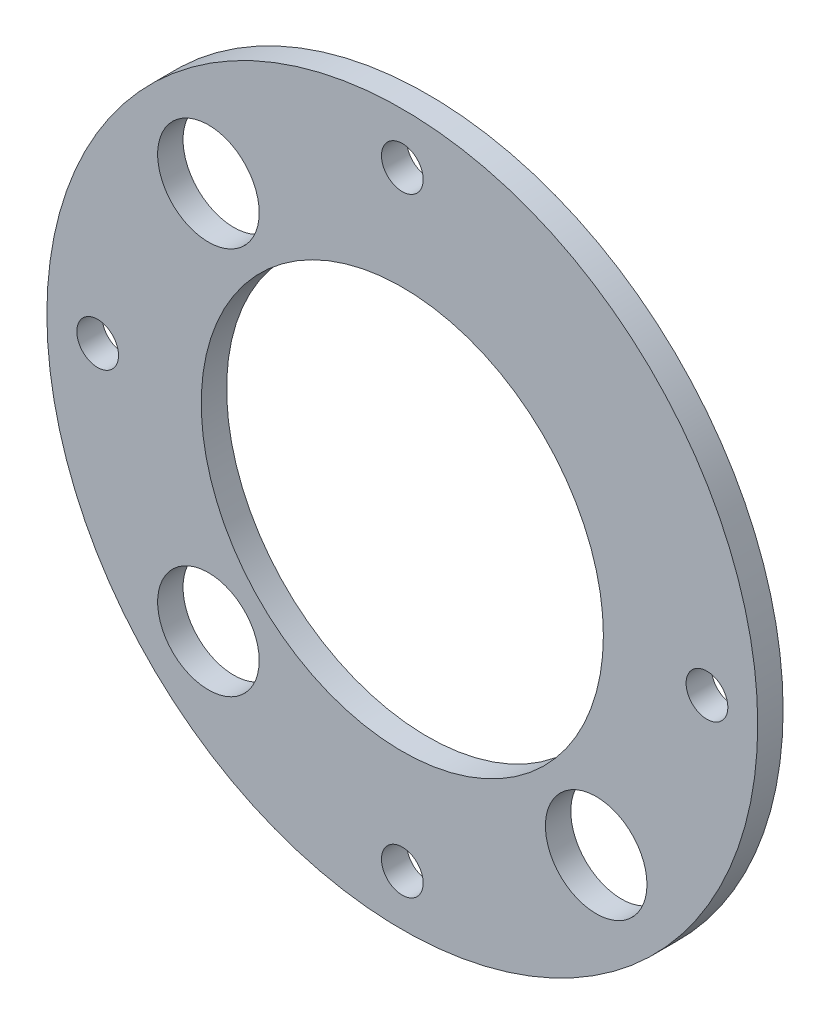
ISO-10303-21;
HEADER;
FILE_DESCRIPTION(('STEP AP214'),'2;1');
FILE_NAME('part.step','',(''),(''),'','','');
FILE_SCHEMA(('AUTOMOTIVE_DESIGN { 1 0 10303 214 1 1 1 1 }'));
ENDSEC;
DATA;
#1=APPLICATION_CONTEXT('core data for automotive mechanical design processes');
#2=APPLICATION_PROTOCOL_DEFINITION('international standard','automotive_design',2000,#1);
#3=PRODUCT_CONTEXT('',#1,'mechanical');
#4=PRODUCT('Part','Part','',(#3));
#5=PRODUCT_RELATED_PRODUCT_CATEGORY('part','',(#4));
#6=PRODUCT_DEFINITION_FORMATION('','',#4);
#7=PRODUCT_DEFINITION_CONTEXT('part definition',#1,'design');
#8=PRODUCT_DEFINITION('design','',#6,#7);
#9=PRODUCT_DEFINITION_SHAPE('','',#8);
#10=(LENGTH_UNIT() NAMED_UNIT(*) SI_UNIT(.MILLI.,.METRE.));
#11=(NAMED_UNIT(*) PLANE_ANGLE_UNIT() SI_UNIT($,.RADIAN.));
#12=(NAMED_UNIT(*) SI_UNIT($,.STERADIAN.) SOLID_ANGLE_UNIT());
#13=UNCERTAINTY_MEASURE_WITH_UNIT(LENGTH_MEASURE(1.E-05),#10,'distance_accuracy_value','');
#14=(GEOMETRIC_REPRESENTATION_CONTEXT(3) GLOBAL_UNCERTAINTY_ASSIGNED_CONTEXT((#13)) GLOBAL_UNIT_ASSIGNED_CONTEXT((#10,
#11,#12)) REPRESENTATION_CONTEXT('',''));
#15=CARTESIAN_POINT('',(0.,0.,0.));
#16=DIRECTION('',(0.,0.,1.));
#17=DIRECTION('',(1.,0.,0.));
#18=AXIS2_PLACEMENT_3D('',#15,#16,#17);
#19=CARTESIAN_POINT('',(0.,0.,3.175));
#20=DIRECTION('',(0.,0.,1.));
#21=DIRECTION('',(1.,0.,0.));
#22=AXIS2_PLACEMENT_3D('',#19,#20,#21);
#23=PLANE('',#22);
#24=CARTESIAN_POINT('',(24.2466915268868,-24.2466915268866,3.175));
#25=DIRECTION('',(0.,0.,1.));
#26=DIRECTION('',(1.,0.,0.));
#27=AXIS2_PLACEMENT_3D('',#24,#25,#26);
#28=CIRCLE('',#27,6.35);
#29=CARTESIAN_POINT('',(30.5966915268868,-24.2466915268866,3.175));
#30=VERTEX_POINT('',#29);
#31=EDGE_CURVE('E88',#30,#30,#28,.T.);
#32=ORIENTED_EDGE('',*,*,#31,.F.);
#33=EDGE_LOOP('',(#32));
#34=FACE_BOUND('',#33,.T.);
#35=CARTESIAN_POINT('',(-24.2466915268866,-24.2466915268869,3.175));
#36=DIRECTION('',(0.,0.,1.));
#37=DIRECTION('',(1.,0.,0.));
#38=AXIS2_PLACEMENT_3D('',#35,#36,#37);
#39=CIRCLE('',#38,6.35);
#40=CARTESIAN_POINT('',(-17.8966915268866,-24.2466915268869,3.175));
#41=VERTEX_POINT('',#40);
#42=EDGE_CURVE('E82',#41,#41,#39,.T.);
#43=ORIENTED_EDGE('',*,*,#42,.F.);
#44=EDGE_LOOP('',(#43));
#45=FACE_BOUND('',#44,.T.);
#46=CARTESIAN_POINT('',(-24.2466915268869,24.2466915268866,3.175));
#47=DIRECTION('',(0.,0.,1.));
#48=DIRECTION('',(1.,0.,0.));
#49=AXIS2_PLACEMENT_3D('',#46,#47,#48);
#50=CIRCLE('',#49,6.35);
#51=CARTESIAN_POINT('',(-17.8966915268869,24.2466915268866,3.175));
#52=VERTEX_POINT('',#51);
#53=EDGE_CURVE('E76',#52,#52,#50,.T.);
#54=ORIENTED_EDGE('',*,*,#53,.F.);
#55=EDGE_LOOP('',(#54));
#56=FACE_BOUND('',#55,.T.);
#57=CARTESIAN_POINT('',(0.,38.1,3.175));
#58=DIRECTION('',(0.,0.,-1.));
#59=DIRECTION('',(-1.,0.,0.));
#60=AXIS2_PLACEMENT_3D('',#57,#58,#59);
#61=CIRCLE('',#60,2.60985);
#62=CARTESIAN_POINT('',(-2.60985,38.1,3.175));
#63=VERTEX_POINT('',#62);
#64=EDGE_CURVE('E69',#63,#63,#61,.T.);
#65=ORIENTED_EDGE('',*,*,#64,.T.);
#66=EDGE_LOOP('',(#65));
#67=FACE_BOUND('',#66,.T.);
#68=CARTESIAN_POINT('',(0.,0.,3.175));
#69=DIRECTION('',(0.,0.,1.));
#70=DIRECTION('',(1.,0.,0.));
#71=AXIS2_PLACEMENT_3D('',#68,#69,#70);
#72=CIRCLE('',#71,25.146);
#73=CARTESIAN_POINT('',(25.146,0.,3.175));
#74=VERTEX_POINT('',#73);
#75=EDGE_CURVE('E44',#74,#74,#72,.T.);
#76=ORIENTED_EDGE('',*,*,#75,.F.);
#77=EDGE_LOOP('',(#76));
#78=FACE_BOUND('',#77,.T.);
#79=CARTESIAN_POINT('',(0.,0.,3.175));
#80=DIRECTION('',(0.,0.,1.));
#81=DIRECTION('',(1.,0.,0.));
#82=AXIS2_PLACEMENT_3D('',#79,#80,#81);
#83=CIRCLE('',#82,44.45);
#84=CARTESIAN_POINT('',(44.45,0.,3.175));
#85=VERTEX_POINT('',#84);
#86=EDGE_CURVE('E10',#85,#85,#83,.T.);
#87=ORIENTED_EDGE('',*,*,#86,.T.);
#88=EDGE_LOOP('',(#87));
#89=FACE_BOUND('',#88,.T.);
#90=CARTESIAN_POINT('',(38.1,0.,3.175));
#91=DIRECTION('',(0.,0.,-1.));
#92=DIRECTION('',(-1.,0.,0.));
#93=AXIS2_PLACEMENT_3D('',#90,#91,#92);
#94=CIRCLE('',#93,2.60985);
#95=CARTESIAN_POINT('',(35.49015,0.,3.175));
#96=VERTEX_POINT('',#95);
#97=EDGE_CURVE('E49',#96,#96,#94,.T.);
#98=ORIENTED_EDGE('',*,*,#97,.T.);
#99=EDGE_LOOP('',(#98));
#100=FACE_BOUND('',#99,.T.);
#101=CARTESIAN_POINT('',(0.,-38.1,3.175));
#102=DIRECTION('',(0.,0.,-1.));
#103=DIRECTION('',(-1.,0.,0.));
#104=AXIS2_PLACEMENT_3D('',#101,#102,#103);
#105=CIRCLE('',#104,2.60985);
#106=CARTESIAN_POINT('',(-2.60984999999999,-38.1,3.175));
#107=VERTEX_POINT('',#106);
#108=EDGE_CURVE('E57',#107,#107,#105,.T.);
#109=ORIENTED_EDGE('',*,*,#108,.T.);
#110=EDGE_LOOP('',(#109));
#111=FACE_BOUND('',#110,.T.);
#112=CARTESIAN_POINT('',(-38.1,0.,3.175));
#113=DIRECTION('',(0.,0.,-1.));
#114=DIRECTION('',(-1.,0.,0.));
#115=AXIS2_PLACEMENT_3D('',#112,#113,#114);
#116=CIRCLE('',#115,2.60985);
#117=CARTESIAN_POINT('',(-40.70985,0.,3.175));
#118=VERTEX_POINT('',#117);
#119=EDGE_CURVE('E63',#118,#118,#116,.T.);
#120=ORIENTED_EDGE('',*,*,#119,.T.);
#121=EDGE_LOOP('',(#120));
#122=FACE_BOUND('',#121,.T.);
#123=ADVANCED_FACE('F33',(#34,#45,#56,#67,#78,#89,#100,#111,#122),#23,.T.);
#124=CARTESIAN_POINT('',(0.,0.,0.));
#125=DIRECTION('',(0.,0.,1.));
#126=DIRECTION('',(1.,0.,0.));
#127=AXIS2_PLACEMENT_3D('',#124,#125,#126);
#128=PLANE('',#127);
#129=CARTESIAN_POINT('',(24.2466915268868,-24.2466915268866,0.));
#130=DIRECTION('',(0.,0.,1.));
#131=DIRECTION('',(1.,0.,0.));
#132=AXIS2_PLACEMENT_3D('',#129,#130,#131);
#133=CIRCLE('',#132,6.35);
#134=CARTESIAN_POINT('',(30.5966915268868,-24.2466915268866,0.));
#135=VERTEX_POINT('',#134);
#136=EDGE_CURVE('E75',#135,#135,#133,.T.);
#137=ORIENTED_EDGE('',*,*,#136,.T.);
#138=EDGE_LOOP('',(#137));
#139=FACE_BOUND('',#138,.T.);
#140=CARTESIAN_POINT('',(-24.2466915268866,-24.2466915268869,0.));
#141=DIRECTION('',(0.,0.,1.));
#142=DIRECTION('',(1.,0.,0.));
#143=AXIS2_PLACEMENT_3D('',#140,#141,#142);
#144=CIRCLE('',#143,6.35);
#145=CARTESIAN_POINT('',(-17.8966915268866,-24.2466915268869,0.));
#146=VERTEX_POINT('',#145);
#147=EDGE_CURVE('E85',#146,#146,#144,.T.);
#148=ORIENTED_EDGE('',*,*,#147,.T.);
#149=EDGE_LOOP('',(#148));
#150=FACE_BOUND('',#149,.T.);
#151=CARTESIAN_POINT('',(-24.2466915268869,24.2466915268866,0.));
#152=DIRECTION('',(0.,0.,1.));
#153=DIRECTION('',(1.,0.,0.));
#154=AXIS2_PLACEMENT_3D('',#151,#152,#153);
#155=CIRCLE('',#154,6.35);
#156=CARTESIAN_POINT('',(-17.8966915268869,24.2466915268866,0.));
#157=VERTEX_POINT('',#156);
#158=EDGE_CURVE('E79',#157,#157,#155,.T.);
#159=ORIENTED_EDGE('',*,*,#158,.T.);
#160=EDGE_LOOP('',(#159));
#161=FACE_BOUND('',#160,.T.);
#162=CARTESIAN_POINT('',(0.,38.1,0.));
#163=DIRECTION('',(0.,0.,-1.));
#164=DIRECTION('',(-1.,0.,0.));
#165=AXIS2_PLACEMENT_3D('',#162,#163,#164);
#166=CIRCLE('',#165,2.60985);
#167=CARTESIAN_POINT('',(-2.60985,38.1,0.));
#168=VERTEX_POINT('',#167);
#169=EDGE_CURVE('E72',#168,#168,#166,.T.);
#170=ORIENTED_EDGE('',*,*,#169,.F.);
#171=EDGE_LOOP('',(#170));
#172=FACE_BOUND('',#171,.T.);
#173=CARTESIAN_POINT('',(-38.1,0.,0.));
#174=DIRECTION('',(0.,0.,-1.));
#175=DIRECTION('',(-1.,0.,0.));
#176=AXIS2_PLACEMENT_3D('',#173,#174,#175);
#177=CIRCLE('',#176,2.60985);
#178=CARTESIAN_POINT('',(-40.70985,0.,0.));
#179=VERTEX_POINT('',#178);
#180=EDGE_CURVE('E66',#179,#179,#177,.T.);
#181=ORIENTED_EDGE('',*,*,#180,.F.);
#182=EDGE_LOOP('',(#181));
#183=FACE_BOUND('',#182,.T.);
#184=CARTESIAN_POINT('',(0.,-38.1,0.));
#185=DIRECTION('',(0.,0.,-1.));
#186=DIRECTION('',(-1.,0.,0.));
#187=AXIS2_PLACEMENT_3D('',#184,#185,#186);
#188=CIRCLE('',#187,2.60985);
#189=CARTESIAN_POINT('',(-2.60985,-38.1,0.));
#190=VERTEX_POINT('',#189);
#191=EDGE_CURVE('E60',#190,#190,#188,.T.);
#192=ORIENTED_EDGE('',*,*,#191,.F.);
#193=EDGE_LOOP('',(#192));
#194=FACE_BOUND('',#193,.T.);
#195=CARTESIAN_POINT('',(38.1,0.,0.));
#196=DIRECTION('',(0.,0.,-1.));
#197=DIRECTION('',(-1.,0.,0.));
#198=AXIS2_PLACEMENT_3D('',#195,#196,#197);
#199=CIRCLE('',#198,2.60985);
#200=CARTESIAN_POINT('',(35.49015,0.,0.));
#201=VERTEX_POINT('',#200);
#202=EDGE_CURVE('E54',#201,#201,#199,.T.);
#203=ORIENTED_EDGE('',*,*,#202,.F.);
#204=EDGE_LOOP('',(#203));
#205=FACE_BOUND('',#204,.T.);
#206=CARTESIAN_POINT('',(0.,0.,0.));
#207=DIRECTION('',(0.,0.,1.));
#208=DIRECTION('',(1.,0.,0.));
#209=AXIS2_PLACEMENT_3D('',#206,#207,#208);
#210=CIRCLE('',#209,44.45);
#211=CARTESIAN_POINT('',(44.45,0.,0.));
#212=VERTEX_POINT('',#211);
#213=EDGE_CURVE('E37',#212,#212,#210,.T.);
#214=ORIENTED_EDGE('',*,*,#213,.F.);
#215=EDGE_LOOP('',(#214));
#216=FACE_BOUND('',#215,.T.);
#217=CARTESIAN_POINT('',(0.,0.,0.));
#218=DIRECTION('',(0.,0.,1.));
#219=DIRECTION('',(1.,0.,0.));
#220=AXIS2_PLACEMENT_3D('',#217,#218,#219);
#221=CIRCLE('',#220,25.146);
#222=CARTESIAN_POINT('',(25.146,0.,0.));
#223=VERTEX_POINT('',#222);
#224=EDGE_CURVE('E46',#223,#223,#221,.T.);
#225=ORIENTED_EDGE('',*,*,#224,.T.);
#226=EDGE_LOOP('',(#225));
#227=FACE_BOUND('',#226,.T.);
#228=ADVANCED_FACE('F94',(#139,#150,#161,#172,#183,#194,#205,#216,#227),#128,.F.);
#229=CARTESIAN_POINT('',(0.,0.,3.175));
#230=DIRECTION('',(0.,0.,-1.));
#231=DIRECTION('',(-1.,0.,0.));
#232=AXIS2_PLACEMENT_3D('',#229,#230,#231);
#233=CYLINDRICAL_SURFACE('',#232,44.45);
#234=ORIENTED_EDGE('',*,*,#86,.F.);
#235=EDGE_LOOP('',(#234));
#236=FACE_BOUND('',#235,.T.);
#237=ORIENTED_EDGE('',*,*,#213,.T.);
#238=EDGE_LOOP('',(#237));
#239=FACE_BOUND('',#238,.T.);
#240=ADVANCED_FACE('F35',(#236,#239),#233,.T.);
#241=CARTESIAN_POINT('',(0.,0.,3.175));
#242=DIRECTION('',(0.,0.,-1.));
#243=DIRECTION('',(-1.,0.,0.));
#244=AXIS2_PLACEMENT_3D('',#241,#242,#243);
#245=CYLINDRICAL_SURFACE('',#244,25.146);
#246=ORIENTED_EDGE('',*,*,#75,.T.);
#247=EDGE_LOOP('',(#246));
#248=FACE_BOUND('',#247,.T.);
#249=ORIENTED_EDGE('',*,*,#224,.F.);
#250=EDGE_LOOP('',(#249));
#251=FACE_BOUND('',#250,.T.);
#252=ADVANCED_FACE('F139',(#248,#251),#245,.F.);
#253=CARTESIAN_POINT('',(38.1,0.,0.));
#254=DIRECTION('',(0.,0.,-1.));
#255=DIRECTION('',(-1.,0.,0.));
#256=AXIS2_PLACEMENT_3D('',#253,#254,#255);
#257=CYLINDRICAL_SURFACE('',#256,2.60985);
#258=ORIENTED_EDGE('',*,*,#97,.F.);
#259=EDGE_LOOP('',(#258));
#260=FACE_BOUND('',#259,.T.);
#261=ORIENTED_EDGE('',*,*,#202,.T.);
#262=EDGE_LOOP('',(#261));
#263=FACE_BOUND('',#262,.T.);
#264=ADVANCED_FACE('F141',(#260,#263),#257,.F.);
#265=CARTESIAN_POINT('',(0.,-38.1,0.));
#266=DIRECTION('',(0.,0.,-1.));
#267=DIRECTION('',(-1.,0.,0.));
#268=AXIS2_PLACEMENT_3D('',#265,#266,#267);
#269=CYLINDRICAL_SURFACE('',#268,2.60985);
#270=ORIENTED_EDGE('',*,*,#108,.F.);
#271=EDGE_LOOP('',(#270));
#272=FACE_BOUND('',#271,.T.);
#273=ORIENTED_EDGE('',*,*,#191,.T.);
#274=EDGE_LOOP('',(#273));
#275=FACE_BOUND('',#274,.T.);
#276=ADVANCED_FACE('F125',(#272,#275),#269,.F.);
#277=CARTESIAN_POINT('',(-38.1,0.,0.));
#278=DIRECTION('',(0.,0.,-1.));
#279=DIRECTION('',(-1.,0.,0.));
#280=AXIS2_PLACEMENT_3D('',#277,#278,#279);
#281=CYLINDRICAL_SURFACE('',#280,2.60985);
#282=ORIENTED_EDGE('',*,*,#119,.F.);
#283=EDGE_LOOP('',(#282));
#284=FACE_BOUND('',#283,.T.);
#285=ORIENTED_EDGE('',*,*,#180,.T.);
#286=EDGE_LOOP('',(#285));
#287=FACE_BOUND('',#286,.T.);
#288=ADVANCED_FACE('F121',(#284,#287),#281,.F.);
#289=CARTESIAN_POINT('',(0.,38.1,0.));
#290=DIRECTION('',(0.,0.,-1.));
#291=DIRECTION('',(-1.,0.,0.));
#292=AXIS2_PLACEMENT_3D('',#289,#290,#291);
#293=CYLINDRICAL_SURFACE('',#292,2.60985);
#294=ORIENTED_EDGE('',*,*,#64,.F.);
#295=EDGE_LOOP('',(#294));
#296=FACE_BOUND('',#295,.T.);
#297=ORIENTED_EDGE('',*,*,#169,.T.);
#298=EDGE_LOOP('',(#297));
#299=FACE_BOUND('',#298,.T.);
#300=ADVANCED_FACE('F124',(#296,#299),#293,.F.);
#301=CARTESIAN_POINT('',(-24.2466915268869,24.2466915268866,0.));
#302=DIRECTION('',(0.,0.,1.));
#303=DIRECTION('',(1.,0.,0.));
#304=AXIS2_PLACEMENT_3D('',#301,#302,#303);
#305=CYLINDRICAL_SURFACE('',#304,6.35);
#306=ORIENTED_EDGE('',*,*,#158,.F.);
#307=EDGE_LOOP('',(#306));
#308=FACE_BOUND('',#307,.T.);
#309=ORIENTED_EDGE('',*,*,#53,.T.);
#310=EDGE_LOOP('',(#309));
#311=FACE_BOUND('',#310,.T.);
#312=ADVANCED_FACE('F157',(#308,#311),#305,.F.);
#313=CARTESIAN_POINT('',(-24.2466915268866,-24.2466915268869,0.));
#314=DIRECTION('',(0.,0.,1.));
#315=DIRECTION('',(1.,0.,0.));
#316=AXIS2_PLACEMENT_3D('',#313,#314,#315);
#317=CYLINDRICAL_SURFACE('',#316,6.35);
#318=ORIENTED_EDGE('',*,*,#147,.F.);
#319=EDGE_LOOP('',(#318));
#320=FACE_BOUND('',#319,.T.);
#321=ORIENTED_EDGE('',*,*,#42,.T.);
#322=EDGE_LOOP('',(#321));
#323=FACE_BOUND('',#322,.T.);
#324=ADVANCED_FACE('F100',(#320,#323),#317,.F.);
#325=CARTESIAN_POINT('',(24.2466915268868,-24.2466915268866,0.));
#326=DIRECTION('',(0.,0.,1.));
#327=DIRECTION('',(1.,0.,0.));
#328=AXIS2_PLACEMENT_3D('',#325,#326,#327);
#329=CYLINDRICAL_SURFACE('',#328,6.35);
#330=ORIENTED_EDGE('',*,*,#136,.F.);
#331=EDGE_LOOP('',(#330));
#332=FACE_BOUND('',#331,.T.);
#333=ORIENTED_EDGE('',*,*,#31,.T.);
#334=EDGE_LOOP('',(#333));
#335=FACE_BOUND('',#334,.T.);
#336=ADVANCED_FACE('F97',(#332,#335),#329,.F.);
#337=CLOSED_SHELL('',(#123,#228,#240,#252,#264,#276,#288,#300,#312,#324,#336));
#338=MANIFOLD_SOLID_BREP('B2',#337);
#339=ADVANCED_BREP_SHAPE_REPRESENTATION('',(#18,#338),#14);
#340=SHAPE_DEFINITION_REPRESENTATION(#9,#339);
ENDSEC;
END-ISO-10303-21;
